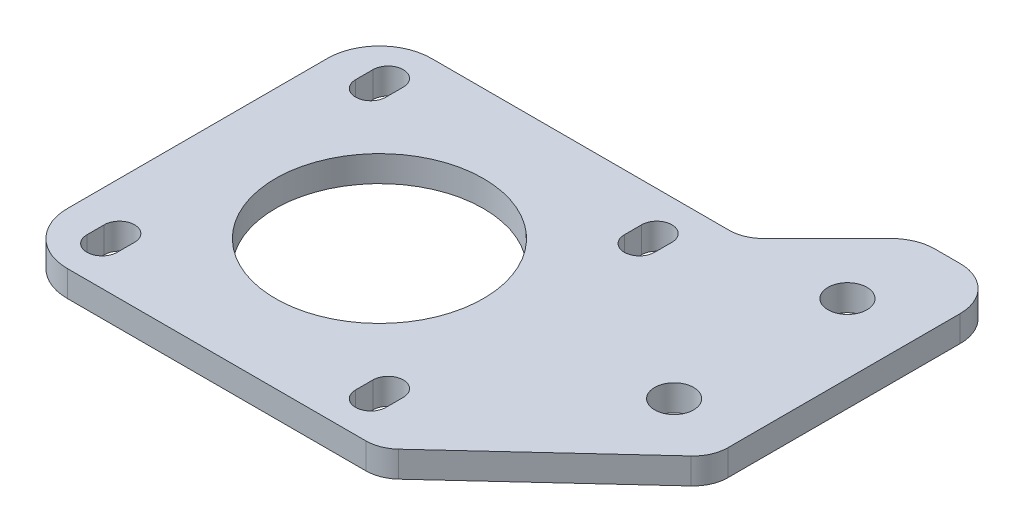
from build123d import *

# Parameters (mm, degrees)
SKETCH2_R           = 12
SKETCH2_R_2         = 2.25
BOSS_EXTRUDE1_DEPTH = 1.5


with BuildPart() as part:
    # Sketch2 → Boss-Extrude1 (new, symmetric)
    with BuildSketch(Plane(origin=(0, 0, 0), x_dir=(1, 0, 0), z_dir=(0, 1, 0))):
        with BuildLine():
            Line((-15, -21), (19.436783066, -21))
            ThreePointArc((19.436783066, -21), (20.892764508, -20.725603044), (22.148987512, -19.94005902))
            Line((22.148987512, -19.94005902), (39.712204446, -3.737991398))
            ThreePointArc((39.712204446, -3.737991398), (40.663933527, -2.402797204), (41, -0.797932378))
            Line((41, -0.797932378), (41, 26))
            ThreePointArc((41, 26), (39.535533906, 29.535533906), (36, 31))
            Line((36, 31), (33.071067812, 31))
            ThreePointArc((33.071067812, 31), (31.15765065, 30.619397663), (29.535533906, 29.535533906))
            Line((29.535533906, 29.535533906), (22.171572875, 22.171572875))
            ThreePointArc((22.171572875, 22.171572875), (20.87387948, 21.30448187), (19.343145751, 21))
            Line((19.343145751, 21), (-15, 21))
            ThreePointArc((-15, 21), (-19.242640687, 19.242640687), (-21, 15))
            Line((-21, 15), (-21, -15))
            ThreePointArc((-21, -15), (-19.242640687, -19.242640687), (-15, -21))
        make_face()
        with Locations(Location((0, 0, 0), (0, 0, 90))):
            Circle(SKETCH2_R, mode=Mode.SUBTRACT)
        with Locations(Location((33, 1, 0), (0, 0, 90))):
            Circle(SKETCH2_R_2, mode=Mode.SUBTRACT)
        with Locations(Location((33, 21, 0), (0, 0, 90))):
            Circle(SKETCH2_R_2, mode=Mode.SUBTRACT)
        with BuildLine():
            Line((17.25, -14.5), (17.25, -16.5))
            ThreePointArc((17.25, -16.5), (15.5, -18.25), (13.75, -16.5))
            Line((13.75, -16.5), (13.75, -14.5))
            ThreePointArc((13.75, -14.5), (15.5, -12.75), (17.25, -14.5))
        make_face(mode=Mode.SUBTRACT)
        with BuildLine():
            Line((-13.75, -14.5), (-13.75, -16.5))
            ThreePointArc((-13.75, -16.5), (-15.5, -18.25), (-17.25, -16.5))
            Line((-17.25, -16.5), (-17.25, -14.5))
            ThreePointArc((-17.25, -14.5), (-15.5, -12.75), (-13.75, -14.5))
        make_face(mode=Mode.SUBTRACT)
        with BuildLine():
            Line((13.75, 14.5), (13.75, 16.5))
            ThreePointArc((13.75, 16.5), (15.5, 18.25), (17.25, 16.5))
            Line((17.25, 16.5), (17.25, 14.5))
            ThreePointArc((17.25, 14.5), (15.5, 12.75), (13.75, 14.5))
        make_face(mode=Mode.SUBTRACT)
        with BuildLine():
            Line((-17.25, 14.5), (-17.25, 16.5))
            ThreePointArc((-17.25, 16.5), (-15.5, 18.25), (-13.75, 16.5))
            Line((-13.75, 16.5), (-13.75, 14.5))
            ThreePointArc((-13.75, 14.5), (-15.5, 12.75), (-17.25, 14.5))
        make_face(mode=Mode.SUBTRACT)
    extrude(amount=BOSS_EXTRUDE1_DEPTH, both=True)


solid = part.part
